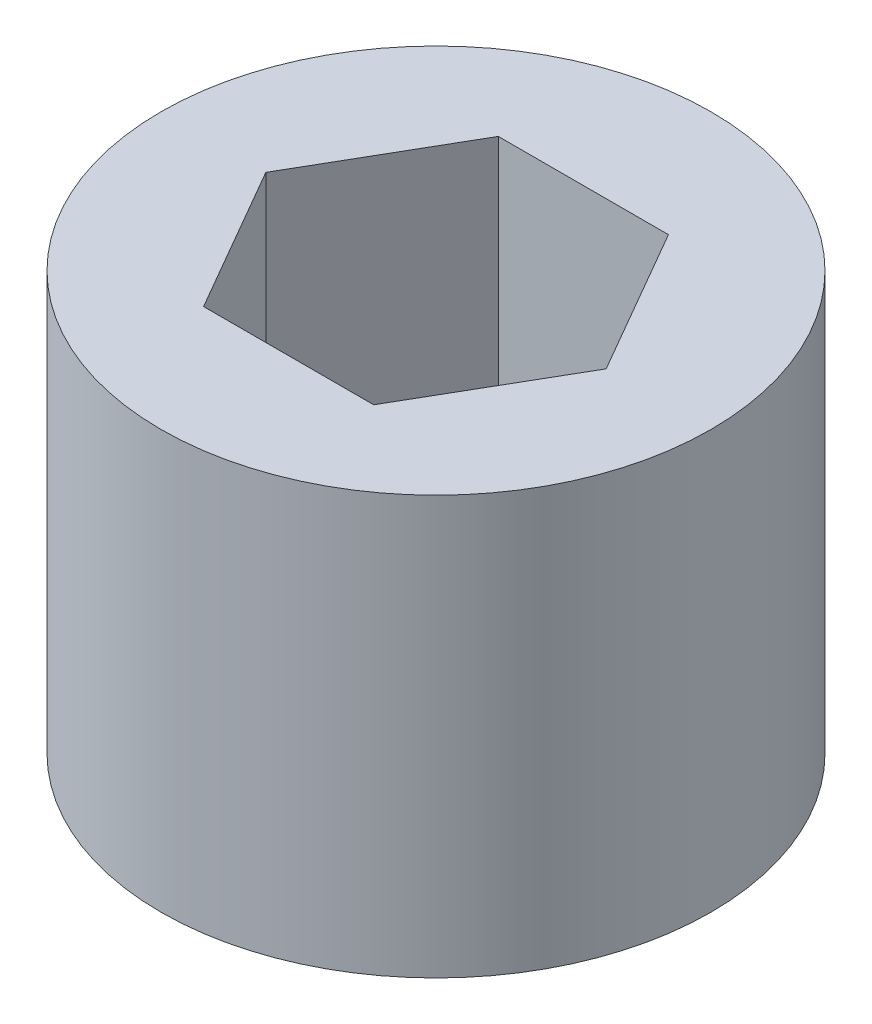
ISO-10303-21;
HEADER;
FILE_DESCRIPTION(('STEP AP214'),'2;1');
FILE_NAME('part.step','',(''),(''),'','','');
FILE_SCHEMA(('AUTOMOTIVE_DESIGN { 1 0 10303 214 1 1 1 1 }'));
ENDSEC;
DATA;
#1=APPLICATION_CONTEXT('core data for automotive mechanical design processes');
#2=APPLICATION_PROTOCOL_DEFINITION('international standard','automotive_design',2000,#1);
#3=PRODUCT_CONTEXT('',#1,'mechanical');
#4=PRODUCT('Part','Part','',(#3));
#5=PRODUCT_RELATED_PRODUCT_CATEGORY('part','',(#4));
#6=PRODUCT_DEFINITION_FORMATION('','',#4);
#7=PRODUCT_DEFINITION_CONTEXT('part definition',#1,'design');
#8=PRODUCT_DEFINITION('design','',#6,#7);
#9=PRODUCT_DEFINITION_SHAPE('','',#8);
#10=(LENGTH_UNIT() NAMED_UNIT(*) SI_UNIT(.MILLI.,.METRE.));
#11=(NAMED_UNIT(*) PLANE_ANGLE_UNIT() SI_UNIT($,.RADIAN.));
#12=(NAMED_UNIT(*) SI_UNIT($,.STERADIAN.) SOLID_ANGLE_UNIT());
#13=UNCERTAINTY_MEASURE_WITH_UNIT(LENGTH_MEASURE(1.E-05),#10,'distance_accuracy_value','');
#14=(GEOMETRIC_REPRESENTATION_CONTEXT(3) GLOBAL_UNCERTAINTY_ASSIGNED_CONTEXT((#13)) GLOBAL_UNIT_ASSIGNED_CONTEXT((#10,
#11,#12)) REPRESENTATION_CONTEXT('',''));
#15=CARTESIAN_POINT('',(0.,0.,0.));
#16=DIRECTION('',(0.,0.,1.));
#17=DIRECTION('',(1.,0.,0.));
#18=AXIS2_PLACEMENT_3D('',#15,#16,#17);
#19=CARTESIAN_POINT('',(0.,6.7564,0.));
#20=DIRECTION('',(0.,-1.,0.));
#21=DIRECTION('',(0.,0.,-1.));
#22=AXIS2_PLACEMENT_3D('',#19,#20,#21);
#23=CYLINDRICAL_SURFACE('',#22,4.445);
#24=CARTESIAN_POINT('',(0.,6.7564,0.));
#25=DIRECTION('',(0.,1.,0.));
#26=DIRECTION('',(0.,0.,1.));
#27=AXIS2_PLACEMENT_3D('',#24,#25,#26);
#28=CIRCLE('',#27,4.445);
#29=CARTESIAN_POINT('',(0.,6.7564,4.445));
#30=VERTEX_POINT('',#29);
#31=EDGE_CURVE('E11',#30,#30,#28,.T.);
#32=ORIENTED_EDGE('',*,*,#31,.F.);
#33=EDGE_LOOP('',(#32));
#34=FACE_BOUND('',#33,.T.);
#35=CARTESIAN_POINT('',(0.,0.,0.));
#36=DIRECTION('',(0.,1.,0.));
#37=DIRECTION('',(0.,0.,1.));
#38=AXIS2_PLACEMENT_3D('',#35,#36,#37);
#39=CIRCLE('',#38,4.445);
#40=CARTESIAN_POINT('',(0.,0.,4.445));
#41=VERTEX_POINT('',#40);
#42=EDGE_CURVE('E37',#41,#41,#39,.T.);
#43=ORIENTED_EDGE('',*,*,#42,.T.);
#44=EDGE_LOOP('',(#43));
#45=FACE_BOUND('',#44,.T.);
#46=ADVANCED_FACE('F34',(#34,#45),#23,.T.);
#47=CARTESIAN_POINT('',(0.,6.7564,0.));
#48=DIRECTION('',(0.,1.,0.));
#49=DIRECTION('',(0.,0.,1.));
#50=AXIS2_PLACEMENT_3D('',#47,#48,#49);
#51=PLANE('',#50);
#52=DIRECTION('',(1.,0.,0.));
#53=VECTOR('',#52,1.);
#54=CARTESIAN_POINT('',(-1.3748153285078,6.7564,2.38125));
#55=LINE('',#54,#53);
#56=CARTESIAN_POINT('',(-1.3748153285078,6.7564,2.38125));
#57=VERTEX_POINT('',#56);
#58=CARTESIAN_POINT('',(1.3748153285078,6.7564,2.38125));
#59=VERTEX_POINT('',#58);
#60=EDGE_CURVE('E48',#57,#59,#55,.T.);
#61=ORIENTED_EDGE('',*,*,#60,.F.);
#62=DIRECTION('',(0.5,0.,0.866025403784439));
#63=VECTOR('',#62,1.);
#64=CARTESIAN_POINT('',(-2.74963065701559,6.7564,0.));
#65=LINE('',#64,#63);
#66=CARTESIAN_POINT('',(-2.74963065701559,6.7564,0.));
#67=VERTEX_POINT('',#66);
#68=EDGE_CURVE('E131',#67,#57,#65,.T.);
#69=ORIENTED_EDGE('',*,*,#68,.F.);
#70=DIRECTION('',(-0.5,0.,0.866025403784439));
#71=VECTOR('',#70,1.);
#72=CARTESIAN_POINT('',(-1.3748153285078,6.7564,-2.38125));
#73=LINE('',#72,#71);
#74=CARTESIAN_POINT('',(-1.3748153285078,6.7564,-2.38125));
#75=VERTEX_POINT('',#74);
#76=EDGE_CURVE('E129',#75,#67,#73,.T.);
#77=ORIENTED_EDGE('',*,*,#76,.F.);
#78=DIRECTION('',(-1.,0.,0.));
#79=VECTOR('',#78,1.);
#80=CARTESIAN_POINT('',(1.37481532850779,6.7564,-2.38125));
#81=LINE('',#80,#79);
#82=CARTESIAN_POINT('',(1.37481532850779,6.7564,-2.38125));
#83=VERTEX_POINT('',#82);
#84=EDGE_CURVE('E96',#83,#75,#81,.T.);
#85=ORIENTED_EDGE('',*,*,#84,.F.);
#86=DIRECTION('',(-0.5,0.,-0.866025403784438));
#87=VECTOR('',#86,1.);
#88=CARTESIAN_POINT('',(2.74963065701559,6.7564,0.));
#89=LINE('',#88,#87);
#90=CARTESIAN_POINT('',(2.74963065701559,6.7564,0.));
#91=VERTEX_POINT('',#90);
#92=EDGE_CURVE('E125',#91,#83,#89,.T.);
#93=ORIENTED_EDGE('',*,*,#92,.F.);
#94=DIRECTION('',(0.5,0.,-0.866025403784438));
#95=VECTOR('',#94,1.);
#96=CARTESIAN_POINT('',(1.3748153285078,6.7564,2.38125));
#97=LINE('',#96,#95);
#98=EDGE_CURVE('E122',#59,#91,#97,.T.);
#99=ORIENTED_EDGE('',*,*,#98,.F.);
#100=EDGE_LOOP('',(#61,#69,#77,#85,#93,#99));
#101=FACE_BOUND('',#100,.T.);
#102=ORIENTED_EDGE('',*,*,#31,.T.);
#103=EDGE_LOOP('',(#102));
#104=FACE_BOUND('',#103,.T.);
#105=ADVANCED_FACE('F144',(#101,#104),#51,.T.);
#106=CARTESIAN_POINT('',(0.,0.,0.));
#107=DIRECTION('',(0.,1.,0.));
#108=DIRECTION('',(0.,0.,1.));
#109=AXIS2_PLACEMENT_3D('',#106,#107,#108);
#110=PLANE('',#109);
#111=ORIENTED_EDGE('',*,*,#42,.F.);
#112=EDGE_LOOP('',(#111));
#113=FACE_BOUND('',#112,.T.);
#114=ADVANCED_FACE('F153',(#113),#110,.F.);
#115=CARTESIAN_POINT('',(-1.3748153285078,1.9812,2.38125));
#116=DIRECTION('',(0.,0.,1.));
#117=DIRECTION('',(1.,0.,0.));
#118=AXIS2_PLACEMENT_3D('',#115,#116,#117);
#119=PLANE('',#118);
#120=ORIENTED_EDGE('',*,*,#60,.T.);
#121=DIRECTION('',(0.,1.,0.));
#122=VECTOR('',#121,1.);
#123=CARTESIAN_POINT('',(1.3748153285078,1.9812,2.38125));
#124=LINE('',#123,#122);
#125=CARTESIAN_POINT('',(1.3748153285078,1.9812,2.38125));
#126=VERTEX_POINT('',#125);
#127=EDGE_CURVE('E78',#126,#59,#124,.T.);
#128=ORIENTED_EDGE('',*,*,#127,.F.);
#129=DIRECTION('',(1.,0.,0.));
#130=VECTOR('',#129,1.);
#131=CARTESIAN_POINT('',(-1.3748153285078,1.9812,2.38125));
#132=LINE('',#131,#130);
#133=CARTESIAN_POINT('',(-1.3748153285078,1.9812,2.38125));
#134=VERTEX_POINT('',#133);
#135=EDGE_CURVE('E133',#134,#126,#132,.T.);
#136=ORIENTED_EDGE('',*,*,#135,.F.);
#137=DIRECTION('',(0.,1.,0.));
#138=VECTOR('',#137,1.);
#139=CARTESIAN_POINT('',(-1.3748153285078,1.9812,2.38125));
#140=LINE('',#139,#138);
#141=EDGE_CURVE('E56',#134,#57,#140,.T.);
#142=ORIENTED_EDGE('',*,*,#141,.T.);
#143=EDGE_LOOP('',(#120,#128,#136,#142));
#144=FACE_BOUND('',#143,.T.);
#145=ADVANCED_FACE('F150',(#144),#119,.F.);
#146=CARTESIAN_POINT('',(-2.74963065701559,1.9812,0.));
#147=DIRECTION('',(-0.866025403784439,0.,0.5));
#148=DIRECTION('',(0.5,0.,0.866025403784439));
#149=AXIS2_PLACEMENT_3D('',#146,#147,#148);
#150=PLANE('',#149);
#151=ORIENTED_EDGE('',*,*,#68,.T.);
#152=ORIENTED_EDGE('',*,*,#141,.F.);
#153=DIRECTION('',(0.5,0.,0.866025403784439));
#154=VECTOR('',#153,1.);
#155=CARTESIAN_POINT('',(-2.74963065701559,1.9812,0.));
#156=LINE('',#155,#154);
#157=CARTESIAN_POINT('',(-2.74963065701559,1.9812,0.));
#158=VERTEX_POINT('',#157);
#159=EDGE_CURVE('E108',#158,#134,#156,.T.);
#160=ORIENTED_EDGE('',*,*,#159,.F.);
#161=DIRECTION('',(0.,1.,0.));
#162=VECTOR('',#161,1.);
#163=CARTESIAN_POINT('',(-2.74963065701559,1.9812,0.));
#164=LINE('',#163,#162);
#165=EDGE_CURVE('E100',#158,#67,#164,.T.);
#166=ORIENTED_EDGE('',*,*,#165,.T.);
#167=EDGE_LOOP('',(#151,#152,#160,#166));
#168=FACE_BOUND('',#167,.T.);
#169=ADVANCED_FACE('F152',(#168),#150,.F.);
#170=CARTESIAN_POINT('',(-1.3748153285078,1.9812,-2.38125));
#171=DIRECTION('',(-0.866025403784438,0.,-0.5));
#172=DIRECTION('',(-0.5,0.,0.866025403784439));
#173=AXIS2_PLACEMENT_3D('',#170,#171,#172);
#174=PLANE('',#173);
#175=ORIENTED_EDGE('',*,*,#76,.T.);
#176=ORIENTED_EDGE('',*,*,#165,.F.);
#177=DIRECTION('',(-0.5,0.,0.866025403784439));
#178=VECTOR('',#177,1.);
#179=CARTESIAN_POINT('',(-1.3748153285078,1.9812,-2.38125));
#180=LINE('',#179,#178);
#181=CARTESIAN_POINT('',(-1.3748153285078,1.9812,-2.38125));
#182=VERTEX_POINT('',#181);
#183=EDGE_CURVE('E104',#182,#158,#180,.T.);
#184=ORIENTED_EDGE('',*,*,#183,.F.);
#185=DIRECTION('',(0.,1.,0.));
#186=VECTOR('',#185,1.);
#187=CARTESIAN_POINT('',(-1.3748153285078,1.9812,-2.38125));
#188=LINE('',#187,#186);
#189=EDGE_CURVE('E89',#182,#75,#188,.T.);
#190=ORIENTED_EDGE('',*,*,#189,.T.);
#191=EDGE_LOOP('',(#175,#176,#184,#190));
#192=FACE_BOUND('',#191,.T.);
#193=ADVANCED_FACE('F105',(#192),#174,.F.);
#194=CARTESIAN_POINT('',(1.37481532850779,1.9812,-2.38125));
#195=DIRECTION('',(0.,0.,-1.));
#196=DIRECTION('',(-1.,0.,0.));
#197=AXIS2_PLACEMENT_3D('',#194,#195,#196);
#198=PLANE('',#197);
#199=ORIENTED_EDGE('',*,*,#84,.T.);
#200=ORIENTED_EDGE('',*,*,#189,.F.);
#201=DIRECTION('',(-1.,0.,0.));
#202=VECTOR('',#201,1.);
#203=CARTESIAN_POINT('',(1.37481532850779,1.9812,-2.38125));
#204=LINE('',#203,#202);
#205=CARTESIAN_POINT('',(1.37481532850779,1.9812,-2.38125));
#206=VERTEX_POINT('',#205);
#207=EDGE_CURVE('E93',#206,#182,#204,.T.);
#208=ORIENTED_EDGE('',*,*,#207,.F.);
#209=DIRECTION('',(0.,1.,0.));
#210=VECTOR('',#209,1.);
#211=CARTESIAN_POINT('',(1.37481532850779,1.9812,-2.38125));
#212=LINE('',#211,#210);
#213=EDGE_CURVE('E101',#206,#83,#212,.T.);
#214=ORIENTED_EDGE('',*,*,#213,.T.);
#215=EDGE_LOOP('',(#199,#200,#208,#214));
#216=FACE_BOUND('',#215,.T.);
#217=ADVANCED_FACE('F91',(#216),#198,.F.);
#218=CARTESIAN_POINT('',(2.74963065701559,1.9812,0.));
#219=DIRECTION('',(0.866025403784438,0.,-0.5));
#220=DIRECTION('',(-0.5,0.,-0.866025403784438));
#221=AXIS2_PLACEMENT_3D('',#218,#219,#220);
#222=PLANE('',#221);
#223=ORIENTED_EDGE('',*,*,#92,.T.);
#224=ORIENTED_EDGE('',*,*,#213,.F.);
#225=DIRECTION('',(-0.5,0.,-0.866025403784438));
#226=VECTOR('',#225,1.);
#227=CARTESIAN_POINT('',(2.74963065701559,1.9812,0.));
#228=LINE('',#227,#226);
#229=CARTESIAN_POINT('',(2.74963065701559,1.9812,0.));
#230=VERTEX_POINT('',#229);
#231=EDGE_CURVE('E114',#230,#206,#228,.T.);
#232=ORIENTED_EDGE('',*,*,#231,.F.);
#233=DIRECTION('',(0.,1.,0.));
#234=VECTOR('',#233,1.);
#235=CARTESIAN_POINT('',(2.74963065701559,1.9812,0.));
#236=LINE('',#235,#234);
#237=EDGE_CURVE('E137',#230,#91,#236,.T.);
#238=ORIENTED_EDGE('',*,*,#237,.T.);
#239=EDGE_LOOP('',(#223,#224,#232,#238));
#240=FACE_BOUND('',#239,.T.);
#241=ADVANCED_FACE('F148',(#240),#222,.F.);
#242=CARTESIAN_POINT('',(1.3748153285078,1.9812,2.38125));
#243=DIRECTION('',(0.866025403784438,0.,0.5));
#244=DIRECTION('',(0.5,0.,-0.866025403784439));
#245=AXIS2_PLACEMENT_3D('',#242,#243,#244);
#246=PLANE('',#245);
#247=ORIENTED_EDGE('',*,*,#98,.T.);
#248=ORIENTED_EDGE('',*,*,#237,.F.);
#249=DIRECTION('',(0.5,0.,-0.866025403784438));
#250=VECTOR('',#249,1.);
#251=CARTESIAN_POINT('',(1.3748153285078,1.9812,2.38125));
#252=LINE('',#251,#250);
#253=EDGE_CURVE('E116',#126,#230,#252,.T.);
#254=ORIENTED_EDGE('',*,*,#253,.F.);
#255=ORIENTED_EDGE('',*,*,#127,.T.);
#256=EDGE_LOOP('',(#247,#248,#254,#255));
#257=FACE_BOUND('',#256,.T.);
#258=ADVANCED_FACE('F141',(#257),#246,.F.);
#259=CARTESIAN_POINT('',(1.3748153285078,1.9812,2.38125));
#260=DIRECTION('',(0.,1.,0.));
#261=DIRECTION('',(0.,0.,1.));
#262=AXIS2_PLACEMENT_3D('',#259,#260,#261);
#263=PLANE('',#262);
#264=ORIENTED_EDGE('',*,*,#135,.T.);
#265=ORIENTED_EDGE('',*,*,#253,.T.);
#266=ORIENTED_EDGE('',*,*,#231,.T.);
#267=ORIENTED_EDGE('',*,*,#207,.T.);
#268=ORIENTED_EDGE('',*,*,#183,.T.);
#269=ORIENTED_EDGE('',*,*,#159,.T.);
#270=EDGE_LOOP('',(#264,#265,#266,#267,#268,#269));
#271=FACE_BOUND('',#270,.T.);
#272=ADVANCED_FACE('F111',(#271),#263,.T.);
#273=CLOSED_SHELL('',(#46,#105,#114,#145,#169,#193,#217,#241,#258,#272));
#274=MANIFOLD_SOLID_BREP('B2',#273);
#275=ADVANCED_BREP_SHAPE_REPRESENTATION('',(#18,#274),#14);
#276=SHAPE_DEFINITION_REPRESENTATION(#9,#275);
ENDSEC;
END-ISO-10303-21;
